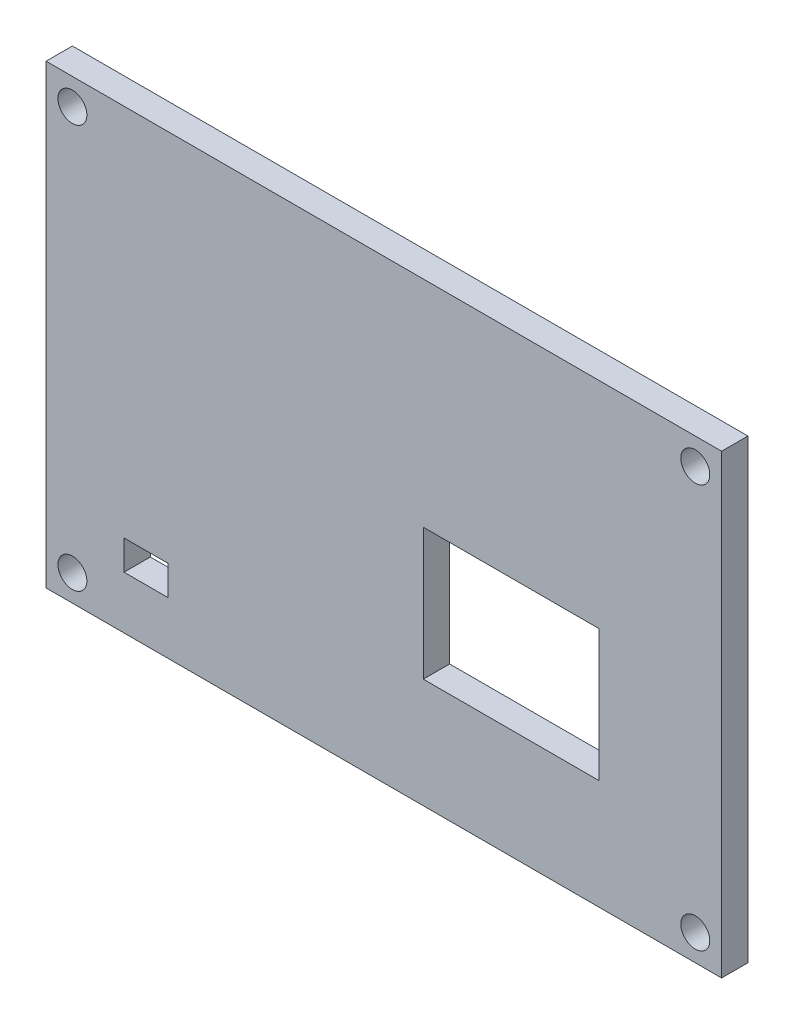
from build123d import *

# Parameters (mm, degrees)
CROQUIS1_W              = 77
CROQUIS1_H              = 52
CROQUIS1_R              = 1.65
CROQUIS1_W_2            = 20
CROQUIS1_H_2            = 15
CROQUIS1_W_3            = 5.007478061
CROQUIS1_H_3            = 3.381673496
SALIENTE_EXTRUIR1_DEPTH = 3


with BuildPart() as part:
    # Croquis1 → Saliente-Extruir1 (new body)
    with BuildSketch(Plane.XY):
        Rectangle(CROQUIS1_W, CROQUIS1_H)
        with Locations((-35.5, 23)):
            Circle(CROQUIS1_R, mode=Mode.SUBTRACT)
        with Locations(Location((35.5, 23, 0), (0, 0, 180))):
            Circle(CROQUIS1_R, mode=Mode.SUBTRACT)
        with Locations((35.5, -23)):
            Circle(CROQUIS1_R, mode=Mode.SUBTRACT)
        with Locations(Location((-35.5, -23, 0), (0, 0, 180))):
            Circle(CROQUIS1_R, mode=Mode.SUBTRACT)
        with Locations((14.5, -6)):
            Rectangle(CROQUIS1_W_2, CROQUIS1_H_2, mode=Mode.SUBTRACT)
        with Locations((-27.111645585, -18.309163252)):
            Rectangle(CROQUIS1_W_3, CROQUIS1_H_3, mode=Mode.SUBTRACT)
    extrude(amount=SALIENTE_EXTRUIR1_DEPTH)


solid = part.part
